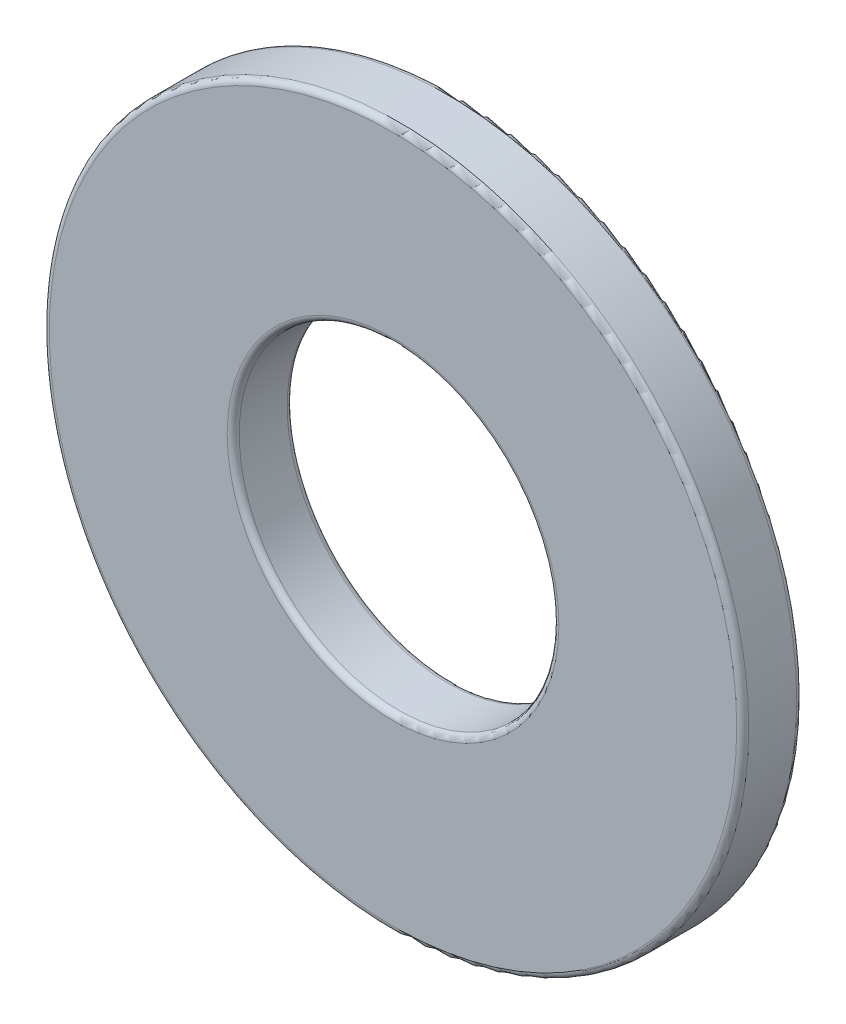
from build123d import *

# Parameters (mm, degrees)
BOSS_EXTRUDE1_DEPTH      = 0.3
BOSS_EXTRUDE1_DEPTH_BACK = 0.3
SKETCH3_R                = 3.5
SKETCH3_R_2              = 1.6
FILLET1_R                = 0.06


with BuildPart() as part:
    # Sketch3 → Boss-Extrude1 (new, two sides: drawn at the far end of the back side and taken through both)
    with BuildSketch(Plane.XY.offset(-BOSS_EXTRUDE1_DEPTH_BACK)):
        Circle(SKETCH3_R)
        Circle(SKETCH3_R_2, mode=Mode.SUBTRACT)
    extrude(amount=BOSS_EXTRUDE1_DEPTH + BOSS_EXTRUDE1_DEPTH_BACK)

    # Fillet1
    fillet1_edges = [part.edges().sort_by_distance(p)[0] for p in [
        (-3.5, 0, -0.3),
        (-1.6, 0, -0.3),
        (-3.5, 0, 0.3),
        (-1.6, 0, 0.3),
    ]]
    fillet(fillet1_edges, radius=FILLET1_R)


solid = part.part
